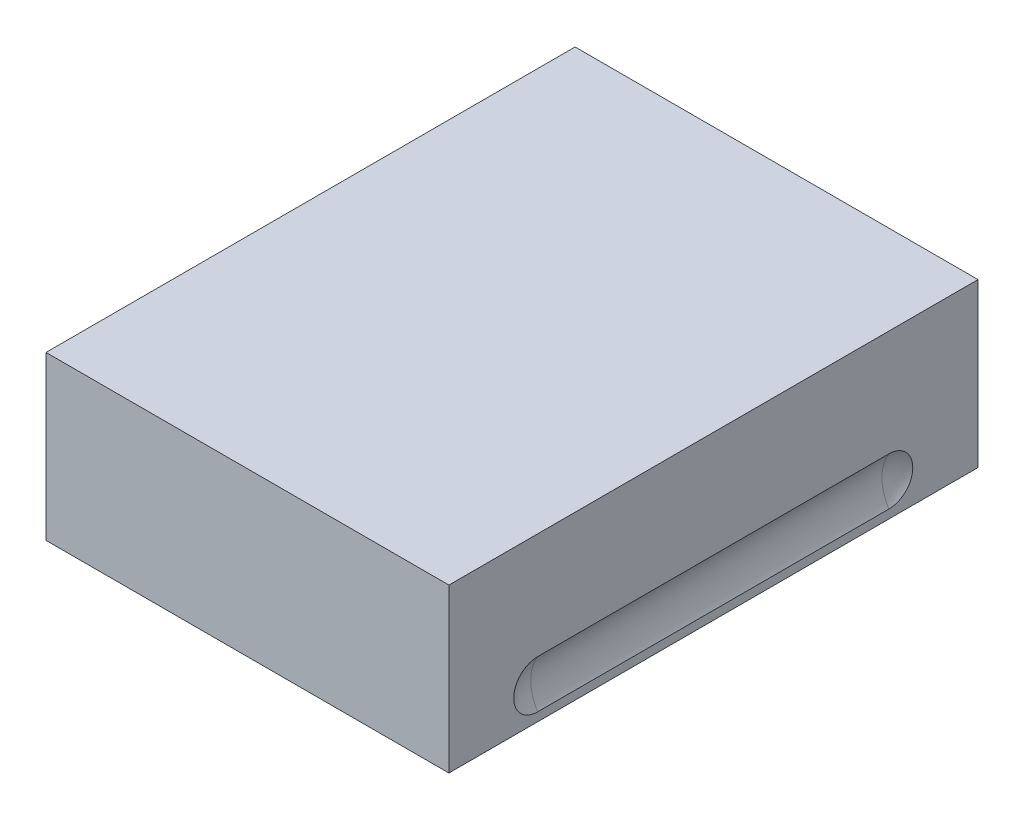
ISO-10303-21;
HEADER;
FILE_DESCRIPTION(('STEP AP214'),'2;1');
FILE_NAME('part.step','',(''),(''),'','','');
FILE_SCHEMA(('AUTOMOTIVE_DESIGN { 1 0 10303 214 1 1 1 1 }'));
ENDSEC;
DATA;
#1=APPLICATION_CONTEXT('core data for automotive mechanical design processes');
#2=APPLICATION_PROTOCOL_DEFINITION('international standard','automotive_design',2000,#1);
#3=PRODUCT_CONTEXT('',#1,'mechanical');
#4=PRODUCT('Part','Part','',(#3));
#5=PRODUCT_RELATED_PRODUCT_CATEGORY('part','',(#4));
#6=PRODUCT_DEFINITION_FORMATION('','',#4);
#7=PRODUCT_DEFINITION_CONTEXT('part definition',#1,'design');
#8=PRODUCT_DEFINITION('design','',#6,#7);
#9=PRODUCT_DEFINITION_SHAPE('','',#8);
#10=(LENGTH_UNIT() NAMED_UNIT(*) SI_UNIT(.MILLI.,.METRE.));
#11=(NAMED_UNIT(*) PLANE_ANGLE_UNIT() SI_UNIT($,.RADIAN.));
#12=(NAMED_UNIT(*) SI_UNIT($,.STERADIAN.) SOLID_ANGLE_UNIT());
#13=UNCERTAINTY_MEASURE_WITH_UNIT(LENGTH_MEASURE(1.E-05),#10,'distance_accuracy_value','');
#14=(GEOMETRIC_REPRESENTATION_CONTEXT(3) GLOBAL_UNCERTAINTY_ASSIGNED_CONTEXT((#13)) GLOBAL_UNIT_ASSIGNED_CONTEXT((#10,
#11,#12)) REPRESENTATION_CONTEXT('',''));
#15=CARTESIAN_POINT('',(0.,0.,0.));
#16=DIRECTION('',(0.,0.,1.));
#17=DIRECTION('',(1.,0.,0.));
#18=AXIS2_PLACEMENT_3D('',#15,#16,#17);
#19=CARTESIAN_POINT('',(0.,67.,-125.));
#20=DIRECTION('',(0.,1.,0.));
#21=DIRECTION('',(0.,0.,1.));
#22=AXIS2_PLACEMENT_3D('',#19,#20,#21);
#23=PLANE('',#22);
#24=DIRECTION('',(-1.,0.,0.));
#25=VECTOR('',#24,1.);
#26=CARTESIAN_POINT('',(-16.5,67.,-155.5));
#27=LINE('',#26,#25);
#28=CARTESIAN_POINT('',(-16.5,67.,-155.5));
#29=VERTEX_POINT('',#28);
#30=CARTESIAN_POINT('',(16.5,67.,-155.5));
#31=VERTEX_POINT('',#30);
#32=EDGE_CURVE('E272',#29,#31,#27,.F.);
#33=ORIENTED_EDGE('',*,*,#32,.T.);
#34=DIRECTION('',(0.,0.,-1.));
#35=VECTOR('',#34,1.);
#36=CARTESIAN_POINT('',(16.5,67.,-155.5));
#37=LINE('',#36,#35);
#38=CARTESIAN_POINT('',(16.5,67.,-94.5));
#39=VERTEX_POINT('',#38);
#40=EDGE_CURVE('E271',#31,#39,#37,.F.);
#41=ORIENTED_EDGE('',*,*,#40,.T.);
#42=DIRECTION('',(1.,0.,0.));
#43=VECTOR('',#42,1.);
#44=CARTESIAN_POINT('',(16.5,67.,-94.5));
#45=LINE('',#44,#43);
#46=CARTESIAN_POINT('',(-16.5,67.,-94.5));
#47=VERTEX_POINT('',#46);
#48=EDGE_CURVE('E279',#39,#47,#45,.F.);
#49=ORIENTED_EDGE('',*,*,#48,.T.);
#50=DIRECTION('',(0.,0.,1.));
#51=VECTOR('',#50,1.);
#52=CARTESIAN_POINT('',(-16.5,67.,-94.5));
#53=LINE('',#52,#51);
#54=EDGE_CURVE('E80',#47,#29,#53,.F.);
#55=ORIENTED_EDGE('',*,*,#54,.T.);
#56=EDGE_LOOP('',(#33,#41,#49,#55));
#57=FACE_BOUND('',#56,.T.);
#58=ADVANCED_FACE('F14',(#57),#23,.F.);
#59=CARTESIAN_POINT('',(-16.5,55.,-155.5));
#60=DIRECTION('',(0.,0.,-1.));
#61=DIRECTION('',(-1.,0.,0.));
#62=AXIS2_PLACEMENT_3D('',#59,#60,#61);
#63=PLANE('',#62);
#64=DIRECTION('',(0.,1.,0.));
#65=VECTOR('',#64,1.);
#66=CARTESIAN_POINT('',(-16.5,55.,-155.5));
#67=LINE('',#66,#65);
#68=CARTESIAN_POINT('',(-16.5,55.,-155.5));
#69=VERTEX_POINT('',#68);
#70=EDGE_CURVE('E250',#29,#69,#67,.F.);
#71=ORIENTED_EDGE('',*,*,#70,.T.);
#72=DIRECTION('',(1.,0.,0.));
#73=VECTOR('',#72,1.);
#74=CARTESIAN_POINT('',(0.,55.,-155.5));
#75=LINE('',#74,#73);
#76=CARTESIAN_POINT('',(16.5,55.,-155.5));
#77=VERTEX_POINT('',#76);
#78=EDGE_CURVE('E218',#69,#77,#75,.T.);
#79=ORIENTED_EDGE('',*,*,#78,.T.);
#80=DIRECTION('',(0.,1.,0.));
#81=VECTOR('',#80,1.);
#82=CARTESIAN_POINT('',(16.5,55.,-155.5));
#83=LINE('',#82,#81);
#84=EDGE_CURVE('E263',#77,#31,#83,.T.);
#85=ORIENTED_EDGE('',*,*,#84,.T.);
#86=ORIENTED_EDGE('',*,*,#32,.F.);
#87=EDGE_LOOP('',(#71,#79,#85,#86));
#88=FACE_BOUND('',#87,.T.);
#89=ADVANCED_FACE('F260',(#88),#63,.F.);
#90=CARTESIAN_POINT('',(16.5,55.,-155.5));
#91=DIRECTION('',(1.,0.,0.));
#92=DIRECTION('',(0.,0.,-1.));
#93=AXIS2_PLACEMENT_3D('',#90,#91,#92);
#94=PLANE('',#93);
#95=ORIENTED_EDGE('',*,*,#84,.F.);
#96=DIRECTION('',(0.,0.,1.));
#97=VECTOR('',#96,1.);
#98=CARTESIAN_POINT('',(16.5,55.,-125.));
#99=LINE('',#98,#97);
#100=CARTESIAN_POINT('',(16.5,55.,-94.5));
#101=VERTEX_POINT('',#100);
#102=EDGE_CURVE('E221',#77,#101,#99,.T.);
#103=ORIENTED_EDGE('',*,*,#102,.T.);
#104=DIRECTION('',(0.,1.,0.));
#105=VECTOR('',#104,1.);
#106=CARTESIAN_POINT('',(16.5,55.,-94.5));
#107=LINE('',#106,#105);
#108=EDGE_CURVE('E274',#101,#39,#107,.T.);
#109=ORIENTED_EDGE('',*,*,#108,.T.);
#110=ORIENTED_EDGE('',*,*,#40,.F.);
#111=EDGE_LOOP('',(#95,#103,#109,#110));
#112=FACE_BOUND('',#111,.T.);
#113=ADVANCED_FACE('F268',(#112),#94,.F.);
#114=CARTESIAN_POINT('',(16.5,55.,-94.5));
#115=DIRECTION('',(0.,0.,1.));
#116=DIRECTION('',(1.,0.,0.));
#117=AXIS2_PLACEMENT_3D('',#114,#115,#116);
#118=PLANE('',#117);
#119=ORIENTED_EDGE('',*,*,#108,.F.);
#120=DIRECTION('',(1.,0.,0.));
#121=VECTOR('',#120,1.);
#122=CARTESIAN_POINT('',(0.,55.,-94.5));
#123=LINE('',#122,#121);
#124=CARTESIAN_POINT('',(-16.5,55.,-94.5));
#125=VERTEX_POINT('',#124);
#126=EDGE_CURVE('E233',#101,#125,#123,.F.);
#127=ORIENTED_EDGE('',*,*,#126,.T.);
#128=DIRECTION('',(0.,1.,0.));
#129=VECTOR('',#128,1.);
#130=CARTESIAN_POINT('',(-16.5,55.,-94.5));
#131=LINE('',#130,#129);
#132=EDGE_CURVE('E251',#125,#47,#131,.T.);
#133=ORIENTED_EDGE('',*,*,#132,.T.);
#134=ORIENTED_EDGE('',*,*,#48,.F.);
#135=EDGE_LOOP('',(#119,#127,#133,#134));
#136=FACE_BOUND('',#135,.T.);
#137=ADVANCED_FACE('F288',(#136),#118,.F.);
#138=CARTESIAN_POINT('',(-16.5,55.,-94.5));
#139=DIRECTION('',(-1.,0.,0.));
#140=DIRECTION('',(0.,0.,1.));
#141=AXIS2_PLACEMENT_3D('',#138,#139,#140);
#142=PLANE('',#141);
#143=ORIENTED_EDGE('',*,*,#132,.F.);
#144=DIRECTION('',(0.,0.,1.));
#145=VECTOR('',#144,1.);
#146=CARTESIAN_POINT('',(-16.5,55.,-125.));
#147=LINE('',#146,#145);
#148=EDGE_CURVE('E93',#125,#69,#147,.F.);
#149=ORIENTED_EDGE('',*,*,#148,.T.);
#150=ORIENTED_EDGE('',*,*,#70,.F.);
#151=ORIENTED_EDGE('',*,*,#54,.F.);
#152=EDGE_LOOP('',(#143,#149,#150,#151));
#153=FACE_BOUND('',#152,.T.);
#154=ADVANCED_FACE('F246',(#153),#142,.F.);
#155=CARTESIAN_POINT('',(-58.8,63.,-168.1));
#156=DIRECTION('',(0.466248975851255,0.113123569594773,0.877390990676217));
#157=DIRECTION('',(0.175928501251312,0.960124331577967,-0.217279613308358));
#158=AXIS2_PLACEMENT_3D('',#155,#156,#157);
#159=SPHERICAL_SURFACE('',#158,11.0000000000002);
#160=CARTESIAN_POINT('',(-58.8,63.,-168.1));
#161=DIRECTION('',(0.,0.,-1.));
#162=DIRECTION('',(-1.,0.,0.));
#163=AXIS2_PLACEMENT_3D('',#160,#161,#162);
#164=CIRCLE('',#163,11.);
#165=CARTESIAN_POINT('',(-49.5,57.12547874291,-168.1));
#166=VERTEX_POINT('',#165);
#167=CARTESIAN_POINT('',(-49.5,68.8745212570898,-168.1));
#168=VERTEX_POINT('',#167);
#169=EDGE_CURVE('E18',#166,#168,#164,.F.);
#170=ORIENTED_EDGE('',*,*,#169,.T.);
#171=CARTESIAN_POINT('',(-49.5,57.1254787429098,-168.1));
#172=CARTESIAN_POINT('',(-49.5,57.1254609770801,-168.265222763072));
#173=CARTESIAN_POINT('',(-49.5,57.1324484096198,-168.430442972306));
#174=CARTESIAN_POINT('',(-49.5,57.1603053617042,-168.759701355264));
#175=CARTESIAN_POINT('',(-49.5,57.1811742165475,-168.923739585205));
#176=CARTESIAN_POINT('',(-49.5,57.2366462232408,-169.249358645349));
#177=CARTESIAN_POINT('',(-49.5,57.2712397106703,-169.410941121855));
#178=CARTESIAN_POINT('',(-49.5,57.3539093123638,-169.730617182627));
#179=CARTESIAN_POINT('',(-49.5,57.4019852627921,-169.888710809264));
#180=CARTESIAN_POINT('',(-49.5,57.5112955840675,-170.200332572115));
#181=CARTESIAN_POINT('',(-49.5,57.572533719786,-170.35385938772));
#182=CARTESIAN_POINT('',(-49.5,57.7077496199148,-170.655264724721));
#183=CARTESIAN_POINT('',(-49.5,57.7817320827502,-170.803141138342));
#184=CARTESIAN_POINT('',(-49.5,57.9418494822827,-171.092051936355));
#185=CARTESIAN_POINT('',(-49.5,58.0279775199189,-171.23309014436));
#186=CARTESIAN_POINT('',(-49.5,58.2118396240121,-171.507462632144));
#187=CARTESIAN_POINT('',(-49.5,58.3095779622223,-171.640794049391));
#188=CARTESIAN_POINT('',(-49.5,58.5159043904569,-171.89870361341));
#189=CARTESIAN_POINT('',(-49.5,58.6244887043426,-172.023284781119));
#190=CARTESIAN_POINT('',(-49.5,58.8518058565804,-172.262903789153));
#191=CARTESIAN_POINT('',(-49.5,58.9705424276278,-172.377938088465));
#192=CARTESIAN_POINT('',(-49.5,59.2172584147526,-172.597570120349));
#193=CARTESIAN_POINT('',(-49.5,59.3452358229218,-172.70217010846));
#194=CARTESIAN_POINT('',(-49.5,59.6095954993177,-172.900255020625));
#195=CARTESIAN_POINT('',(-49.5,59.7459808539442,-172.993735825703));
#196=CARTESIAN_POINT('',(-49.5,60.0260855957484,-173.168836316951));
#197=CARTESIAN_POINT('',(-49.5,60.1698019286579,-173.250460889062));
#198=CARTESIAN_POINT('',(-49.5,60.4636534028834,-173.401342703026));
#199=CARTESIAN_POINT('',(-49.5,60.6137908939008,-173.470595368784));
#200=CARTESIAN_POINT('',(-49.5,60.9193010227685,-173.596176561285));
#201=CARTESIAN_POINT('',(-49.5,61.0746713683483,-173.65251066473));
#202=CARTESIAN_POINT('',(-49.5,61.3896627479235,-173.751911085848));
#203=CARTESIAN_POINT('',(-49.5,61.5492853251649,-173.794972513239));
#204=CARTESIAN_POINT('',(-49.5,61.8715365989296,-173.867480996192));
#205=CARTESIAN_POINT('',(-49.5,62.0341642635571,-173.896932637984));
#206=CARTESIAN_POINT('',(-49.5,62.3613792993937,-173.942041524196));
#207=CARTESIAN_POINT('',(-49.5,62.5259673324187,-173.957693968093));
#208=CARTESIAN_POINT('',(-49.5,62.855852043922,-173.975074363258));
#209=CARTESIAN_POINT('',(-49.5,63.0211486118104,-173.976804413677));
#210=CARTESIAN_POINT('',(-49.5,63.351299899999,-173.966333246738));
#211=CARTESIAN_POINT('',(-49.5,63.516154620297,-173.954132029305));
#212=CARTESIAN_POINT('',(-49.5,63.8442771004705,-173.915881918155));
#213=CARTESIAN_POINT('',(-49.5,64.0075445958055,-173.889830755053));
#214=CARTESIAN_POINT('',(-49.5,64.3312476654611,-173.824076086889));
#215=CARTESIAN_POINT('',(-49.5,64.4916842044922,-173.784377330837));
#216=CARTESIAN_POINT('',(-49.5,64.8086997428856,-173.691591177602));
#217=CARTESIAN_POINT('',(-49.5,64.9652773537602,-173.63849903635));
#218=CARTESIAN_POINT('',(-49.5,65.2733455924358,-173.519332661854));
#219=CARTESIAN_POINT('',(-49.5,65.4248380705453,-173.453263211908));
#220=CARTESIAN_POINT('',(-49.5,65.7217786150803,-173.308570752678));
#221=CARTESIAN_POINT('',(-49.5,65.8672242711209,-173.229942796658));
#222=CARTESIAN_POINT('',(-49.5,66.1509207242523,-173.060742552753));
#223=CARTESIAN_POINT('',(-49.5,66.2891741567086,-172.970174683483));
#224=CARTESIAN_POINT('',(-49.5,66.5576043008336,-172.777685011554));
#225=CARTESIAN_POINT('',(-49.5,66.6877784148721,-172.6757595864));
#226=CARTESIAN_POINT('',(-49.5,66.9390295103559,-172.461342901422));
#227=CARTESIAN_POINT('',(-49.5,67.0601098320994,-172.348855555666));
#228=CARTESIAN_POINT('',(-49.5,67.2923933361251,-172.114054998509));
#229=CARTESIAN_POINT('',(-49.5,67.4035941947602,-171.991739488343));
#230=CARTESIAN_POINT('',(-49.5,67.6152570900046,-171.738222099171));
#231=CARTESIAN_POINT('',(-49.5,67.7157230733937,-171.607023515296));
#232=CARTESIAN_POINT('',(-49.5,67.9053147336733,-171.33653871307));
#233=CARTESIAN_POINT('',(-49.5,67.9944325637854,-171.197246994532));
#234=CARTESIAN_POINT('',(-49.5,68.1605822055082,-170.91170173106));
#235=CARTESIAN_POINT('',(-49.5,68.237618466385,-170.765450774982));
#236=CARTESIAN_POINT('',(-49.5,68.3791664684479,-170.466832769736));
#237=CARTESIAN_POINT('',(-49.5,68.4436658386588,-170.314459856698));
#238=CARTESIAN_POINT('',(-49.5,68.5595645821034,-170.004875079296));
#239=CARTESIAN_POINT('',(-49.5,68.6109688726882,-169.847665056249));
#240=CARTESIAN_POINT('',(-49.5,68.7002936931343,-169.529651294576));
#241=CARTESIAN_POINT('',(-49.5,68.7382290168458,-169.368851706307));
#242=CARTESIAN_POINT('',(-49.5,68.8004112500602,-169.044693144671));
#243=CARTESIAN_POINT('',(-49.5,68.8246648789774,-168.88133546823));
#244=CARTESIAN_POINT('',(-49.5,68.8528409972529,-168.614685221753));
#245=CARTESIAN_POINT('',(-49.5,68.8609762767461,-168.51181948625));
#246=CARTESIAN_POINT('',(-49.5,68.8718125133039,-168.305972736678));
#247=CARTESIAN_POINT('',(-49.5,68.8745224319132,-168.202992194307));
#248=CARTESIAN_POINT('',(-49.5,68.8745212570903,-168.1));
#249=B_SPLINE_CURVE_WITH_KNOTS('',3,(#171,#172,#173,#174,#175,#176,#177,#178,#179,#180,#181,
#182,#183,#184,#185,#186,#187,#188,#189,#190,#191,#192,#193,#194,#195,#196,#197,#198,#199,#200,
#201,#202,#203,#204,#205,#206,#207,#208,#209,#210,#211,#212,#213,#214,#215,#216,#217,#218,#219,
#220,#221,#222,#223,#224,#225,#226,#227,#228,#229,#230,#231,#232,#233,#234,#235,#236,#237,#238,
#239,#240,#241,#242,#243,#244,#245,#246,#247,#248),.UNSPECIFIED.,.F.,.F.,(4,2,2,2,2,2,2,2,2,2,2,
2,2,2,2,2,2,2,2,2,2,2,2,2,2,2,2,2,2,2,2,2,2,2,2,2,2,2,4),(0.,0.495516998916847,
0.991010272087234,1.4861552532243,1.9812942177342,2.4765749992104,2.97203876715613,
3.46722222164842,3.96258843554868,4.45778277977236,4.95315998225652,5.44842986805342,
5.94388265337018,6.43913068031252,6.93456151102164,7.42977806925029,7.92517687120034,
8.42040861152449,8.91581256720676,9.41114182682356,9.90647108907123,10.40188153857,
10.8971197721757,11.3925336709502,11.8877653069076,12.3831924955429,12.8784368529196,
13.373839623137,13.8690595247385,14.3643955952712,14.8595489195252,15.3550427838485,
15.8503537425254,16.3461510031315,16.8417618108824,17.3368265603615,17.8316479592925,
18.1410772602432,18.4499950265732),.UNSPECIFIED.);
#250=EDGE_CURVE('E77',#166,#168,#249,.T.);
#251=ORIENTED_EDGE('',*,*,#250,.F.);
#252=EDGE_LOOP('',(#170,#251));
#253=FACE_BOUND('',#252,.T.);
#254=ADVANCED_FACE('F75',(#253),#159,.F.);
#255=CARTESIAN_POINT('',(-58.8,63.,-124.95));
#256=DIRECTION('',(0.,0.,-1.));
#257=DIRECTION('',(-1.,0.,0.));
#258=AXIS2_PLACEMENT_3D('',#255,#256,#257);
#259=CYLINDRICAL_SURFACE('',#258,11.);
#260=ORIENTED_EDGE('',*,*,#169,.F.);
#261=DIRECTION('',(0.,0.,1.));
#262=VECTOR('',#261,1.);
#263=CARTESIAN_POINT('',(-49.5,57.1254787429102,-60.));
#264=LINE('',#263,#262);
#265=CARTESIAN_POINT('',(-49.5,57.1254787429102,-81.8));
#266=VERTEX_POINT('',#265);
#267=EDGE_CURVE('E91',#266,#166,#264,.F.);
#268=ORIENTED_EDGE('',*,*,#267,.F.);
#269=CARTESIAN_POINT('',(-58.8,63.,-81.8));
#270=DIRECTION('',(0.,0.,-1.));
#271=DIRECTION('',(-1.,0.,0.));
#272=AXIS2_PLACEMENT_3D('',#269,#270,#271);
#273=CIRCLE('',#272,11.);
#274=CARTESIAN_POINT('',(-49.5,68.87452125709,-81.8));
#275=VERTEX_POINT('',#274);
#276=EDGE_CURVE('E79',#266,#275,#273,.F.);
#277=ORIENTED_EDGE('',*,*,#276,.T.);
#278=DIRECTION('',(0.,0.,1.));
#279=VECTOR('',#278,1.);
#280=CARTESIAN_POINT('',(-49.5,68.8745212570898,-60.));
#281=LINE('',#280,#279);
#282=EDGE_CURVE('E82',#168,#275,#281,.T.);
#283=ORIENTED_EDGE('',*,*,#282,.F.);
#284=EDGE_LOOP('',(#260,#268,#277,#283));
#285=FACE_BOUND('',#284,.T.);
#286=ADVANCED_FACE('F83',(#285),#259,.F.);
#287=CARTESIAN_POINT('',(-58.8,63.,-81.8));
#288=DIRECTION('',(0.466248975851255,0.113123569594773,0.877390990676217));
#289=DIRECTION('',(0.175928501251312,0.960124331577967,-0.217279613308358));
#290=AXIS2_PLACEMENT_3D('',#287,#288,#289);
#291=SPHERICAL_SURFACE('',#290,11.0000000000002);
#292=ORIENTED_EDGE('',*,*,#276,.F.);
#293=CARTESIAN_POINT('',(-49.5,68.8745212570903,-81.8));
#294=CARTESIAN_POINT('',(-49.5,68.8745390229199,-81.6347772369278));
#295=CARTESIAN_POINT('',(-49.5,68.8675515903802,-81.469557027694));
#296=CARTESIAN_POINT('',(-49.5,68.8396946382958,-81.1402986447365));
#297=CARTESIAN_POINT('',(-49.5,68.8188257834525,-80.9762604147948));
#298=CARTESIAN_POINT('',(-49.5,68.7633537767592,-80.6506413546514));
#299=CARTESIAN_POINT('',(-49.5,68.7287602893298,-80.4890588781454));
#300=CARTESIAN_POINT('',(-49.5,68.6460906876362,-80.1693828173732));
#301=CARTESIAN_POINT('',(-49.5,68.5980147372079,-80.0112891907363));
#302=CARTESIAN_POINT('',(-49.5,68.4887044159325,-79.6996674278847));
#303=CARTESIAN_POINT('',(-49.5,68.427466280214,-79.5461406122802));
#304=CARTESIAN_POINT('',(-49.5,68.2922503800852,-79.2447352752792));
#305=CARTESIAN_POINT('',(-49.5,68.2182679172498,-79.0968588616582));
#306=CARTESIAN_POINT('',(-49.5,68.0581505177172,-78.8079480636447));
#307=CARTESIAN_POINT('',(-49.5,67.9720224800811,-78.6669098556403));
#308=CARTESIAN_POINT('',(-49.5,67.7881603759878,-78.3925373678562));
#309=CARTESIAN_POINT('',(-49.5,67.6904220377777,-78.2592059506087));
#310=CARTESIAN_POINT('',(-49.5,67.4840956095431,-78.0012963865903));
#311=CARTESIAN_POINT('',(-49.5,67.3755112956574,-77.8767152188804));
#312=CARTESIAN_POINT('',(-49.5,67.1481941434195,-77.6370962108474));
#313=CARTESIAN_POINT('',(-49.5,67.0294575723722,-77.5220619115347));
#314=CARTESIAN_POINT('',(-49.5,66.7827415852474,-77.3024298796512));
#315=CARTESIAN_POINT('',(-49.5,66.6547641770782,-77.1978298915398));
#316=CARTESIAN_POINT('',(-49.5,66.3904045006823,-76.9997449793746));
#317=CARTESIAN_POINT('',(-49.5,66.2540191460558,-76.9062641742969));
#318=CARTESIAN_POINT('',(-49.5,65.9739144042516,-76.731163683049));
#319=CARTESIAN_POINT('',(-49.5,65.8301980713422,-76.649539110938));
#320=CARTESIAN_POINT('',(-49.5,65.5363465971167,-76.4986572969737));
#321=CARTESIAN_POINT('',(-49.5,65.3862091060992,-76.429404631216));
#322=CARTESIAN_POINT('',(-49.5,65.0806989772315,-76.3038234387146));
#323=CARTESIAN_POINT('',(-49.5,64.9253286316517,-76.24748933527));
#324=CARTESIAN_POINT('',(-49.5,64.6103372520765,-76.1480889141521));
#325=CARTESIAN_POINT('',(-49.5,64.4507146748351,-76.1050274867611));
#326=CARTESIAN_POINT('',(-49.5,64.1284634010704,-76.0325190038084));
#327=CARTESIAN_POINT('',(-49.5,63.9658357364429,-76.0030673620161));
#328=CARTESIAN_POINT('',(-49.5,63.6386207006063,-75.9579584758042));
#329=CARTESIAN_POINT('',(-49.5,63.4740326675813,-75.9423060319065));
#330=CARTESIAN_POINT('',(-49.5,63.1441479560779,-75.9249256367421));
#331=CARTESIAN_POINT('',(-49.5,62.9788513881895,-75.9231955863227));
#332=CARTESIAN_POINT('',(-49.5,62.6487001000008,-75.9336667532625));
#333=CARTESIAN_POINT('',(-49.5,62.4838453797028,-75.9458679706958));
#334=CARTESIAN_POINT('',(-49.5,62.1557228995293,-75.9841180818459));
#335=CARTESIAN_POINT('',(-49.5,61.9924554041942,-76.010169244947));
#336=CARTESIAN_POINT('',(-49.5,61.6687523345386,-76.0759239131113));
#337=CARTESIAN_POINT('',(-49.5,61.5083157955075,-76.1156226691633));
#338=CARTESIAN_POINT('',(-49.5,61.1913002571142,-76.2084088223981));
#339=CARTESIAN_POINT('',(-49.5,61.0347226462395,-76.2615009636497));
#340=CARTESIAN_POINT('',(-49.5,60.7266544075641,-76.3806673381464));
#341=CARTESIAN_POINT('',(-49.5,60.5751619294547,-76.4467367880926));
#342=CARTESIAN_POINT('',(-49.5,60.2782213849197,-76.5914292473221));
#343=CARTESIAN_POINT('',(-49.5,60.132775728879,-76.6700572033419));
#344=CARTESIAN_POINT('',(-49.5,59.8490792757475,-76.8392574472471));
#345=CARTESIAN_POINT('',(-49.5,59.7108258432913,-76.9298253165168));
#346=CARTESIAN_POINT('',(-49.5,59.4423956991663,-77.1223149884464));
#347=CARTESIAN_POINT('',(-49.5,59.3122215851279,-77.2242404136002));
#348=CARTESIAN_POINT('',(-49.5,59.0609704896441,-77.4386570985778));
#349=CARTESIAN_POINT('',(-49.5,58.9398901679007,-77.5511444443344));
#350=CARTESIAN_POINT('',(-49.5,58.707606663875,-77.7859450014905));
#351=CARTESIAN_POINT('',(-49.5,58.5964058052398,-77.9082605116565));
#352=CARTESIAN_POINT('',(-49.5,58.3847429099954,-78.161777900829));
#353=CARTESIAN_POINT('',(-49.5,58.2842769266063,-78.2929764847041));
#354=CARTESIAN_POINT('',(-49.5,58.0946852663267,-78.5634612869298));
#355=CARTESIAN_POINT('',(-49.5,58.0055674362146,-78.702753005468));
#356=CARTESIAN_POINT('',(-49.5,57.8394177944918,-78.9882982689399));
#357=CARTESIAN_POINT('',(-49.5,57.7623815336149,-79.1345492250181));
#358=CARTESIAN_POINT('',(-49.5,57.6208335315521,-79.4331672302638));
#359=CARTESIAN_POINT('',(-49.5,57.5563341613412,-79.5855401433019));
#360=CARTESIAN_POINT('',(-49.5,57.4404354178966,-79.8951249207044));
#361=CARTESIAN_POINT('',(-49.5,57.3890311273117,-80.0523349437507));
#362=CARTESIAN_POINT('',(-49.5,57.2997063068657,-80.3703487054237));
#363=CARTESIAN_POINT('',(-49.5,57.2617709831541,-80.531148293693));
#364=CARTESIAN_POINT('',(-49.5,57.1995887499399,-80.8553068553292));
#365=CARTESIAN_POINT('',(-49.5,57.1753351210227,-81.0186645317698));
#366=CARTESIAN_POINT('',(-49.5,57.1471590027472,-81.2853147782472));
#367=CARTESIAN_POINT('',(-49.5,57.1390237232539,-81.3881805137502));
#368=CARTESIAN_POINT('',(-49.5,57.128187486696,-81.5940272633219));
#369=CARTESIAN_POINT('',(-49.5,57.1254775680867,-81.6970078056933));
#370=CARTESIAN_POINT('',(-49.5,57.1254787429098,-81.8));
#371=B_SPLINE_CURVE_WITH_KNOTS('',3,(#293,#294,#295,#296,#297,#298,#299,#300,#301,#302,#303,
#304,#305,#306,#307,#308,#309,#310,#311,#312,#313,#314,#315,#316,#317,#318,#319,#320,#321,#322,
#323,#324,#325,#326,#327,#328,#329,#330,#331,#332,#333,#334,#335,#336,#337,#338,#339,#340,#341,
#342,#343,#344,#345,#346,#347,#348,#349,#350,#351,#352,#353,#354,#355,#356,#357,#358,#359,#360,
#361,#362,#363,#364,#365,#366,#367,#368,#369,#370),.UNSPECIFIED.,.F.,.F.,(4,2,2,2,2,2,2,2,2,2,2,
2,2,2,2,2,2,2,2,2,2,2,2,2,2,2,2,2,2,2,2,2,2,2,2,2,2,2,4),(0.,0.495516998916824,
0.991010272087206,1.48615525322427,1.9812942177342,2.47657499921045,2.97203876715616,
3.46722222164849,3.96258843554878,4.45778277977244,4.95315998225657,5.44842986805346,
5.94388265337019,6.43913068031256,6.93456151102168,7.42977806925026,7.92517687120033,
8.42040861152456,8.91581256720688,9.41114182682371,9.90647108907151,10.4018815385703,
10.897119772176,11.3925336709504,11.8877653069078,12.383192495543,12.8784368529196,
13.3738396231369,13.8690595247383,14.364395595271,14.8595489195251,15.3550427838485,
15.8503537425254,16.3461510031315,16.8417618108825,17.3368265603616,17.8316479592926,
18.1410772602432,18.4499950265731),.UNSPECIFIED.);
#372=EDGE_CURVE('E88',#275,#266,#371,.T.);
#373=ORIENTED_EDGE('',*,*,#372,.F.);
#374=EDGE_LOOP('',(#292,#373));
#375=FACE_BOUND('',#374,.T.);
#376=ADVANCED_FACE('F154',(#375),#291,.F.);
#377=CARTESIAN_POINT('',(58.8,63.,-81.8));
#378=DIRECTION('',(0.466248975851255,0.113123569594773,0.877390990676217));
#379=DIRECTION('',(0.175928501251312,0.960124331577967,-0.217279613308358));
#380=AXIS2_PLACEMENT_3D('',#377,#378,#379);
#381=SPHERICAL_SURFACE('',#380,11.0000000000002);
#382=CARTESIAN_POINT('',(58.8,63.,-81.8));
#383=DIRECTION('',(0.,0.,1.));
#384=DIRECTION('',(1.,0.,0.));
#385=AXIS2_PLACEMENT_3D('',#382,#383,#384);
#386=CIRCLE('',#385,11.);
#387=CARTESIAN_POINT('',(49.5,57.12547874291,-81.8));
#388=VERTEX_POINT('',#387);
#389=CARTESIAN_POINT('',(49.5,68.8745212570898,-81.8));
#390=VERTEX_POINT('',#389);
#391=EDGE_CURVE('E219',#388,#390,#386,.F.);
#392=ORIENTED_EDGE('',*,*,#391,.T.);
#393=CARTESIAN_POINT('',(49.5,57.1254787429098,-81.8));
#394=CARTESIAN_POINT('',(49.5,57.1254609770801,-81.6347772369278));
#395=CARTESIAN_POINT('',(49.5,57.1324484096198,-81.469557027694));
#396=CARTESIAN_POINT('',(49.5,57.1603053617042,-81.1402986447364));
#397=CARTESIAN_POINT('',(49.5,57.1811742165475,-80.9762604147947));
#398=CARTESIAN_POINT('',(49.5,57.2366462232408,-80.6506413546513));
#399=CARTESIAN_POINT('',(49.5,57.2712397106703,-80.4890588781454));
#400=CARTESIAN_POINT('',(49.5,57.3539093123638,-80.1693828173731));
#401=CARTESIAN_POINT('',(49.5,57.401985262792,-80.0112891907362));
#402=CARTESIAN_POINT('',(49.5,57.5112955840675,-79.6996674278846));
#403=CARTESIAN_POINT('',(49.5,57.572533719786,-79.5461406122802));
#404=CARTESIAN_POINT('',(49.5,57.7077496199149,-79.2447352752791));
#405=CARTESIAN_POINT('',(49.5,57.7817320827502,-79.0968588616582));
#406=CARTESIAN_POINT('',(49.5,57.9418494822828,-78.8079480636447));
#407=CARTESIAN_POINT('',(49.5,58.027977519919,-78.6669098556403));
#408=CARTESIAN_POINT('',(49.5,58.2118396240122,-78.3925373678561));
#409=CARTESIAN_POINT('',(49.5,58.3095779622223,-78.2592059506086));
#410=CARTESIAN_POINT('',(49.5,58.5159043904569,-78.0012963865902));
#411=CARTESIAN_POINT('',(49.5,58.6244887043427,-77.8767152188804));
#412=CARTESIAN_POINT('',(49.5,58.8518058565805,-77.6370962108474));
#413=CARTESIAN_POINT('',(49.5,58.9705424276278,-77.5220619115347));
#414=CARTESIAN_POINT('',(49.5,59.2172584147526,-77.3024298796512));
#415=CARTESIAN_POINT('',(49.5,59.3452358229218,-77.1978298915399));
#416=CARTESIAN_POINT('',(49.5,59.6095954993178,-76.9997449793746));
#417=CARTESIAN_POINT('',(49.5,59.7459808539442,-76.9062641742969));
#418=CARTESIAN_POINT('',(49.5,60.0260855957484,-76.731163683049));
#419=CARTESIAN_POINT('',(49.5,60.1698019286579,-76.649539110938));
#420=CARTESIAN_POINT('',(49.5,60.4636534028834,-76.4986572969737));
#421=CARTESIAN_POINT('',(49.5,60.6137908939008,-76.429404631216));
#422=CARTESIAN_POINT('',(49.5,60.9193010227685,-76.3038234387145));
#423=CARTESIAN_POINT('',(49.5,61.0746713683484,-76.24748933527));
#424=CARTESIAN_POINT('',(49.5,61.3896627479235,-76.1480889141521));
#425=CARTESIAN_POINT('',(49.5,61.5492853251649,-76.105027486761));
#426=CARTESIAN_POINT('',(49.5,61.8715365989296,-76.0325190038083));
#427=CARTESIAN_POINT('',(49.5,62.0341642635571,-76.0030673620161));
#428=CARTESIAN_POINT('',(49.5,62.3613792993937,-75.9579584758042));
#429=CARTESIAN_POINT('',(49.5,62.5259673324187,-75.9423060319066));
#430=CARTESIAN_POINT('',(49.5,62.8558520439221,-75.9249256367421));
#431=CARTESIAN_POINT('',(49.5,63.0211486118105,-75.9231955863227));
#432=CARTESIAN_POINT('',(49.5,63.3512998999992,-75.9336667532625));
#433=CARTESIAN_POINT('',(49.5,63.5161546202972,-75.9458679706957));
#434=CARTESIAN_POINT('',(49.5,63.8442771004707,-75.9841180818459));
#435=CARTESIAN_POINT('',(49.5,64.0075445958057,-76.010169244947));
#436=CARTESIAN_POINT('',(49.5,64.3312476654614,-76.0759239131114));
#437=CARTESIAN_POINT('',(49.5,64.4916842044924,-76.1156226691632));
#438=CARTESIAN_POINT('',(49.5,64.8086997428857,-76.2084088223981));
#439=CARTESIAN_POINT('',(49.5,64.9652773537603,-76.2615009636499));
#440=CARTESIAN_POINT('',(49.5,65.2733455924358,-76.3806673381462));
#441=CARTESIAN_POINT('',(49.5,65.4248380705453,-76.446736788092));
#442=CARTESIAN_POINT('',(49.5,65.7217786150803,-76.5914292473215));
#443=CARTESIAN_POINT('',(49.5,65.8672242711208,-76.6700572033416));
#444=CARTESIAN_POINT('',(49.5,66.1509207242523,-76.8392574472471));
#445=CARTESIAN_POINT('',(49.5,66.2891741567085,-76.9298253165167));
#446=CARTESIAN_POINT('',(49.5,66.5576043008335,-77.1223149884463));
#447=CARTESIAN_POINT('',(49.5,66.6877784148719,-77.2242404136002));
#448=CARTESIAN_POINT('',(49.5,66.9390295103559,-77.4386570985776));
#449=CARTESIAN_POINT('',(49.5,67.0601098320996,-77.5511444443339));
#450=CARTESIAN_POINT('',(49.5,67.2923933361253,-77.78594500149));
#451=CARTESIAN_POINT('',(49.5,67.4035941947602,-77.9082605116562));
#452=CARTESIAN_POINT('',(49.5,67.6152570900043,-78.161777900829));
#453=CARTESIAN_POINT('',(49.5,67.7157230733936,-78.292976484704));
#454=CARTESIAN_POINT('',(49.5,67.9053147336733,-78.5634612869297));
#455=CARTESIAN_POINT('',(49.5,67.9944325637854,-78.702753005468));
#456=CARTESIAN_POINT('',(49.5,68.1605822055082,-78.9882982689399));
#457=CARTESIAN_POINT('',(49.5,68.237618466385,-79.1345492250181));
#458=CARTESIAN_POINT('',(49.5,68.3791664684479,-79.4331672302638));
#459=CARTESIAN_POINT('',(49.5,68.4436658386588,-79.585540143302));
#460=CARTESIAN_POINT('',(49.5,68.5595645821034,-79.8951249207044));
#461=CARTESIAN_POINT('',(49.5,68.6109688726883,-80.0523349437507));
#462=CARTESIAN_POINT('',(49.5,68.7002936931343,-80.3703487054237));
#463=CARTESIAN_POINT('',(49.5,68.7382290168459,-80.531148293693));
#464=CARTESIAN_POINT('',(49.5,68.8004112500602,-80.8553068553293));
#465=CARTESIAN_POINT('',(49.5,68.8246648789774,-81.0186645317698));
#466=CARTESIAN_POINT('',(49.5,68.8528409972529,-81.2853147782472));
#467=CARTESIAN_POINT('',(49.5,68.8609762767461,-81.3881805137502));
#468=CARTESIAN_POINT('',(49.5,68.871812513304,-81.5940272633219));
#469=CARTESIAN_POINT('',(49.5,68.8745224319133,-81.6970078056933));
#470=CARTESIAN_POINT('',(49.5,68.8745212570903,-81.8));
#471=B_SPLINE_CURVE_WITH_KNOTS('',3,(#393,#394,#395,#396,#397,#398,#399,#400,#401,#402,#403,
#404,#405,#406,#407,#408,#409,#410,#411,#412,#413,#414,#415,#416,#417,#418,#419,#420,#421,#422,
#423,#424,#425,#426,#427,#428,#429,#430,#431,#432,#433,#434,#435,#436,#437,#438,#439,#440,#441,
#442,#443,#444,#445,#446,#447,#448,#449,#450,#451,#452,#453,#454,#455,#456,#457,#458,#459,#460,
#461,#462,#463,#464,#465,#466,#467,#468,#469,#470),.UNSPECIFIED.,.F.,.F.,(4,2,2,2,2,2,2,2,2,2,2,
2,2,2,2,2,2,2,2,2,2,2,2,2,2,2,2,2,2,2,2,2,2,2,2,2,2,2,4),(0.,0.495516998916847,
0.991010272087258,1.48615525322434,1.98129421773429,2.47657499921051,2.97203876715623,
3.46722222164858,3.96258843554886,4.45778277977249,4.9531599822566,5.44842986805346,
5.94388265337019,6.43913068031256,6.9345615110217,7.42977806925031,7.92517687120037,
8.42040861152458,8.91581256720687,9.41114182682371,9.90647108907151,10.4018815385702,
10.8971197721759,11.3925336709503,11.8877653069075,12.3831924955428,12.8784368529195,
13.3738396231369,13.8690595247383,14.364395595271,14.8595489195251,15.3550427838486,
15.8503537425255,16.3461510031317,16.8417618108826,17.3368265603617,17.8316479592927,
18.1410772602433,18.4499950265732),.UNSPECIFIED.);
#472=EDGE_CURVE('E139',#388,#390,#471,.T.);
#473=ORIENTED_EDGE('',*,*,#472,.F.);
#474=EDGE_LOOP('',(#392,#473));
#475=FACE_BOUND('',#474,.T.);
#476=ADVANCED_FACE('F148',(#475),#381,.F.);
#477=CARTESIAN_POINT('',(58.8,63.,-124.95));
#478=DIRECTION('',(0.,0.,1.));
#479=DIRECTION('',(1.,0.,0.));
#480=AXIS2_PLACEMENT_3D('',#477,#478,#479);
#481=CYLINDRICAL_SURFACE('',#480,11.);
#482=ORIENTED_EDGE('',*,*,#391,.F.);
#483=DIRECTION('',(0.,0.,-1.));
#484=VECTOR('',#483,1.);
#485=CARTESIAN_POINT('',(49.5,57.1254787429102,-190.));
#486=LINE('',#485,#484);
#487=CARTESIAN_POINT('',(49.5,57.1254787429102,-168.1));
#488=VERTEX_POINT('',#487);
#489=EDGE_CURVE('E147',#488,#388,#486,.F.);
#490=ORIENTED_EDGE('',*,*,#489,.F.);
#491=CARTESIAN_POINT('',(58.8,63.,-168.1));
#492=DIRECTION('',(0.,0.,1.));
#493=DIRECTION('',(1.,0.,0.));
#494=AXIS2_PLACEMENT_3D('',#491,#492,#493);
#495=CIRCLE('',#494,11.);
#496=CARTESIAN_POINT('',(49.5,68.8745212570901,-168.1));
#497=VERTEX_POINT('',#496);
#498=EDGE_CURVE('E109',#488,#497,#495,.F.);
#499=ORIENTED_EDGE('',*,*,#498,.T.);
#500=DIRECTION('',(0.,0.,-1.));
#501=VECTOR('',#500,1.);
#502=CARTESIAN_POINT('',(49.5,68.8745212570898,-190.));
#503=LINE('',#502,#501);
#504=EDGE_CURVE('E146',#390,#497,#503,.T.);
#505=ORIENTED_EDGE('',*,*,#504,.F.);
#506=EDGE_LOOP('',(#482,#490,#499,#505));
#507=FACE_BOUND('',#506,.T.);
#508=ADVANCED_FACE('F153',(#507),#481,.F.);
#509=CARTESIAN_POINT('',(58.8,63.,-168.1));
#510=DIRECTION('',(0.466248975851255,0.113123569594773,0.877390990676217));
#511=DIRECTION('',(0.175928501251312,0.960124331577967,-0.217279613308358));
#512=AXIS2_PLACEMENT_3D('',#509,#510,#511);
#513=SPHERICAL_SURFACE('',#512,11.0000000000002);
#514=ORIENTED_EDGE('',*,*,#498,.F.);
#515=CARTESIAN_POINT('',(49.5,68.8745212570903,-168.1));
#516=CARTESIAN_POINT('',(49.5,68.8745390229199,-168.265222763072));
#517=CARTESIAN_POINT('',(49.5,68.8675515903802,-168.430442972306));
#518=CARTESIAN_POINT('',(49.5,68.8396946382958,-168.759701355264));
#519=CARTESIAN_POINT('',(49.5,68.8188257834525,-168.923739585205));
#520=CARTESIAN_POINT('',(49.5,68.7633537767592,-169.249358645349));
#521=CARTESIAN_POINT('',(49.5,68.7287602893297,-169.410941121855));
#522=CARTESIAN_POINT('',(49.5,68.6460906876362,-169.730617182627));
#523=CARTESIAN_POINT('',(49.5,68.5980147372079,-169.888710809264));
#524=CARTESIAN_POINT('',(49.5,68.4887044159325,-170.200332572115));
#525=CARTESIAN_POINT('',(49.5,68.427466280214,-170.35385938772));
#526=CARTESIAN_POINT('',(49.5,68.2922503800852,-170.655264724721));
#527=CARTESIAN_POINT('',(49.5,68.2182679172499,-170.803141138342));
#528=CARTESIAN_POINT('',(49.5,68.0581505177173,-171.092051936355));
#529=CARTESIAN_POINT('',(49.5,67.9720224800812,-171.23309014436));
#530=CARTESIAN_POINT('',(49.5,67.7881603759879,-171.507462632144));
#531=CARTESIAN_POINT('',(49.5,67.6904220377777,-171.640794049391));
#532=CARTESIAN_POINT('',(49.5,67.4840956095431,-171.89870361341));
#533=CARTESIAN_POINT('',(49.5,67.3755112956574,-172.02328478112));
#534=CARTESIAN_POINT('',(49.5,67.1481941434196,-172.262903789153));
#535=CARTESIAN_POINT('',(49.5,67.0294575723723,-172.377938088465));
#536=CARTESIAN_POINT('',(49.5,66.7827415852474,-172.597570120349));
#537=CARTESIAN_POINT('',(49.5,66.6547641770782,-172.70217010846));
#538=CARTESIAN_POINT('',(49.5,66.3904045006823,-172.900255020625));
#539=CARTESIAN_POINT('',(49.5,66.2540191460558,-172.993735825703));
#540=CARTESIAN_POINT('',(49.5,65.9739144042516,-173.168836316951));
#541=CARTESIAN_POINT('',(49.5,65.8301980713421,-173.250460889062));
#542=CARTESIAN_POINT('',(49.5,65.5363465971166,-173.401342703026));
#543=CARTESIAN_POINT('',(49.5,65.3862091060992,-173.470595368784));
#544=CARTESIAN_POINT('',(49.5,65.0806989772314,-173.596176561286));
#545=CARTESIAN_POINT('',(49.5,64.9253286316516,-173.65251066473));
#546=CARTESIAN_POINT('',(49.5,64.6103372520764,-173.751911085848));
#547=CARTESIAN_POINT('',(49.5,64.450714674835,-173.794972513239));
#548=CARTESIAN_POINT('',(49.5,64.1284634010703,-173.867480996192));
#549=CARTESIAN_POINT('',(49.5,63.9658357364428,-173.896932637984));
#550=CARTESIAN_POINT('',(49.5,63.6386207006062,-173.942041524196));
#551=CARTESIAN_POINT('',(49.5,63.4740326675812,-173.957693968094));
#552=CARTESIAN_POINT('',(49.5,63.1441479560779,-173.975074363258));
#553=CARTESIAN_POINT('',(49.5,62.9788513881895,-173.976804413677));
#554=CARTESIAN_POINT('',(49.5,62.6487001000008,-173.966333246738));
#555=CARTESIAN_POINT('',(49.5,62.4838453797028,-173.954132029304));
#556=CARTESIAN_POINT('',(49.5,62.1557228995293,-173.915881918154));
#557=CARTESIAN_POINT('',(49.5,61.9924554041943,-173.889830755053));
#558=CARTESIAN_POINT('',(49.5,61.6687523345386,-173.824076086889));
#559=CARTESIAN_POINT('',(49.5,61.5083157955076,-173.784377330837));
#560=CARTESIAN_POINT('',(49.5,61.1913002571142,-173.691591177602));
#561=CARTESIAN_POINT('',(49.5,61.0347226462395,-173.63849903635));
#562=CARTESIAN_POINT('',(49.5,60.7266544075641,-173.519332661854));
#563=CARTESIAN_POINT('',(49.5,60.5751619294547,-173.453263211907));
#564=CARTESIAN_POINT('',(49.5,60.2782213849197,-173.308570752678));
#565=CARTESIAN_POINT('',(49.5,60.132775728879,-173.229942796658));
#566=CARTESIAN_POINT('',(49.5,59.8490792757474,-173.060742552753));
#567=CARTESIAN_POINT('',(49.5,59.7108258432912,-172.970174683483));
#568=CARTESIAN_POINT('',(49.5,59.4423956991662,-172.777685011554));
#569=CARTESIAN_POINT('',(49.5,59.3122215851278,-172.6757595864));
#570=CARTESIAN_POINT('',(49.5,59.0609704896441,-172.461342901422));
#571=CARTESIAN_POINT('',(49.5,58.9398901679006,-172.348855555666));
#572=CARTESIAN_POINT('',(49.5,58.7076066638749,-172.114054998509));
#573=CARTESIAN_POINT('',(49.5,58.5964058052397,-171.991739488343));
#574=CARTESIAN_POINT('',(49.5,58.3847429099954,-171.738222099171));
#575=CARTESIAN_POINT('',(49.5,58.2842769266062,-171.607023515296));
#576=CARTESIAN_POINT('',(49.5,58.0946852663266,-171.33653871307));
#577=CARTESIAN_POINT('',(49.5,58.0055674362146,-171.197246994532));
#578=CARTESIAN_POINT('',(49.5,57.8394177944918,-170.91170173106));
#579=CARTESIAN_POINT('',(49.5,57.7623815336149,-170.765450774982));
#580=CARTESIAN_POINT('',(49.5,57.6208335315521,-170.466832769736));
#581=CARTESIAN_POINT('',(49.5,57.5563341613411,-170.314459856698));
#582=CARTESIAN_POINT('',(49.5,57.4404354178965,-170.004875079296));
#583=CARTESIAN_POINT('',(49.5,57.3890311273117,-169.847665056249));
#584=CARTESIAN_POINT('',(49.5,57.2997063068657,-169.529651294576));
#585=CARTESIAN_POINT('',(49.5,57.2617709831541,-169.368851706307));
#586=CARTESIAN_POINT('',(49.5,57.1995887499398,-169.044693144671));
#587=CARTESIAN_POINT('',(49.5,57.1753351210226,-168.88133546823));
#588=CARTESIAN_POINT('',(49.5,57.1471590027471,-168.614685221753));
#589=CARTESIAN_POINT('',(49.5,57.1390237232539,-168.51181948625));
#590=CARTESIAN_POINT('',(49.5,57.128187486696,-168.305972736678));
#591=CARTESIAN_POINT('',(49.5,57.1254775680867,-168.202992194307));
#592=CARTESIAN_POINT('',(49.5,57.1254787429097,-168.1));
#593=B_SPLINE_CURVE_WITH_KNOTS('',3,(#515,#516,#517,#518,#519,#520,#521,#522,#523,#524,#525,
#526,#527,#528,#529,#530,#531,#532,#533,#534,#535,#536,#537,#538,#539,#540,#541,#542,#543,#544,
#545,#546,#547,#548,#549,#550,#551,#552,#553,#554,#555,#556,#557,#558,#559,#560,#561,#562,#563,
#564,#565,#566,#567,#568,#569,#570,#571,#572,#573,#574,#575,#576,#577,#578,#579,#580,#581,#582,
#583,#584,#585,#586,#587,#588,#589,#590,#591,#592),.UNSPECIFIED.,.F.,.F.,(4,2,2,2,2,2,2,2,2,2,2,
2,2,2,2,2,2,2,2,2,2,2,2,2,2,2,2,2,2,2,2,2,2,2,2,2,2,2,4),(0.,0.495516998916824,
0.991010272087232,1.48615525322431,1.98129421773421,2.47657499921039,2.97203876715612,
3.46722222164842,3.9625884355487,4.45778277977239,4.95315998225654,5.44842986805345,
5.9438826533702,6.43913068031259,6.93456151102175,7.4297780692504,7.92517687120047,
8.42040861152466,8.91581256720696,9.41114182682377,9.90647108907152,10.4018815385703,
10.897119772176,11.3925336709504,11.8877653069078,12.3831924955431,12.8784368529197,
13.3738396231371,13.8690595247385,14.3643955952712,14.8595489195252,15.3550427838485,
15.8503537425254,16.3461510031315,16.8417618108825,17.3368265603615,17.8316479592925,
18.1410772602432,18.4499950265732),.UNSPECIFIED.);
#594=EDGE_CURVE('E133',#497,#488,#593,.T.);
#595=ORIENTED_EDGE('',*,*,#594,.F.);
#596=EDGE_LOOP('',(#514,#595));
#597=FACE_BOUND('',#596,.T.);
#598=ADVANCED_FACE('F164',(#597),#513,.F.);
#599=CARTESIAN_POINT('',(0.,55.,-125.));
#600=DIRECTION('',(0.,1.,0.));
#601=DIRECTION('',(0.,0.,1.));
#602=AXIS2_PLACEMENT_3D('',#599,#600,#601);
#603=PLANE('',#602);
#604=DIRECTION('',(0.,0.,1.));
#605=VECTOR('',#604,1.);
#606=CARTESIAN_POINT('',(-49.5,55.,-60.));
#607=LINE('',#606,#605);
#608=CARTESIAN_POINT('',(-49.5,55.,-190.));
#609=VERTEX_POINT('',#608);
#610=CARTESIAN_POINT('',(-49.5,55.,-60.));
#611=VERTEX_POINT('',#610);
#612=EDGE_CURVE('E228',#609,#611,#607,.T.);
#613=ORIENTED_EDGE('',*,*,#612,.F.);
#614=DIRECTION('',(-1.,0.,0.));
#615=VECTOR('',#614,1.);
#616=CARTESIAN_POINT('',(-49.5,55.,-190.));
#617=LINE('',#616,#615);
#618=CARTESIAN_POINT('',(49.5,55.,-190.));
#619=VERTEX_POINT('',#618);
#620=EDGE_CURVE('E196',#619,#609,#617,.T.);
#621=ORIENTED_EDGE('',*,*,#620,.F.);
#622=DIRECTION('',(0.,0.,-1.));
#623=VECTOR('',#622,1.);
#624=CARTESIAN_POINT('',(49.5,55.,-190.));
#625=LINE('',#624,#623);
#626=CARTESIAN_POINT('',(49.5,55.,-60.));
#627=VERTEX_POINT('',#626);
#628=EDGE_CURVE('E203',#627,#619,#625,.T.);
#629=ORIENTED_EDGE('',*,*,#628,.F.);
#630=DIRECTION('',(1.,0.,0.));
#631=VECTOR('',#630,1.);
#632=CARTESIAN_POINT('',(49.5,55.,-60.));
#633=LINE('',#632,#631);
#634=EDGE_CURVE('E224',#611,#627,#633,.T.);
#635=ORIENTED_EDGE('',*,*,#634,.F.);
#636=EDGE_LOOP('',(#613,#621,#629,#635));
#637=FACE_BOUND('',#636,.T.);
#638=ORIENTED_EDGE('',*,*,#126,.F.);
#639=ORIENTED_EDGE('',*,*,#102,.F.);
#640=ORIENTED_EDGE('',*,*,#78,.F.);
#641=ORIENTED_EDGE('',*,*,#148,.F.);
#642=EDGE_LOOP('',(#638,#639,#640,#641));
#643=FACE_BOUND('',#642,.T.);
#644=ADVANCED_FACE('F120',(#637,#643),#603,.F.);
#645=CARTESIAN_POINT('',(-49.5,55.,-60.));
#646=DIRECTION('',(-1.,0.,0.));
#647=DIRECTION('',(0.,0.,1.));
#648=AXIS2_PLACEMENT_3D('',#645,#646,#647);
#649=PLANE('',#648);
#650=ORIENTED_EDGE('',*,*,#612,.T.);
#651=DIRECTION('',(0.,1.,0.));
#652=VECTOR('',#651,1.);
#653=CARTESIAN_POINT('',(-49.5,55.,-60.));
#654=LINE('',#653,#652);
#655=CARTESIAN_POINT('',(-49.5,95.,-60.));
#656=VERTEX_POINT('',#655);
#657=EDGE_CURVE('E210',#656,#611,#654,.F.);
#658=ORIENTED_EDGE('',*,*,#657,.F.);
#659=DIRECTION('',(0.,0.,1.));
#660=VECTOR('',#659,1.);
#661=CARTESIAN_POINT('',(-49.5,95.,-125.));
#662=LINE('',#661,#660);
#663=CARTESIAN_POINT('',(-49.5,95.,-190.));
#664=VERTEX_POINT('',#663);
#665=EDGE_CURVE('E191',#664,#656,#662,.T.);
#666=ORIENTED_EDGE('',*,*,#665,.F.);
#667=DIRECTION('',(0.,1.,0.));
#668=VECTOR('',#667,1.);
#669=CARTESIAN_POINT('',(-49.5,55.,-190.));
#670=LINE('',#669,#668);
#671=EDGE_CURVE('E194',#609,#664,#670,.T.);
#672=ORIENTED_EDGE('',*,*,#671,.F.);
#673=EDGE_LOOP('',(#650,#658,#666,#672));
#674=FACE_BOUND('',#673,.T.);
#675=ORIENTED_EDGE('',*,*,#282,.T.);
#676=ORIENTED_EDGE('',*,*,#372,.T.);
#677=ORIENTED_EDGE('',*,*,#267,.T.);
#678=ORIENTED_EDGE('',*,*,#250,.T.);
#679=EDGE_LOOP('',(#675,#676,#677,#678));
#680=FACE_BOUND('',#679,.T.);
#681=ADVANCED_FACE('F90',(#674,#680),#649,.T.);
#682=CARTESIAN_POINT('',(49.5,55.,-60.));
#683=DIRECTION('',(0.,0.,1.));
#684=DIRECTION('',(1.,0.,0.));
#685=AXIS2_PLACEMENT_3D('',#682,#683,#684);
#686=PLANE('',#685);
#687=ORIENTED_EDGE('',*,*,#634,.T.);
#688=DIRECTION('',(0.,1.,0.));
#689=VECTOR('',#688,1.);
#690=CARTESIAN_POINT('',(49.5,55.,-60.));
#691=LINE('',#690,#689);
#692=CARTESIAN_POINT('',(49.5,95.,-60.));
#693=VERTEX_POINT('',#692);
#694=EDGE_CURVE('E204',#693,#627,#691,.F.);
#695=ORIENTED_EDGE('',*,*,#694,.F.);
#696=DIRECTION('',(1.,0.,0.));
#697=VECTOR('',#696,1.);
#698=CARTESIAN_POINT('',(0.,95.,-60.));
#699=LINE('',#698,#697);
#700=EDGE_CURVE('E188',#656,#693,#699,.T.);
#701=ORIENTED_EDGE('',*,*,#700,.F.);
#702=ORIENTED_EDGE('',*,*,#657,.T.);
#703=EDGE_LOOP('',(#687,#695,#701,#702));
#704=FACE_BOUND('',#703,.T.);
#705=ADVANCED_FACE('F119',(#704),#686,.T.);
#706=CARTESIAN_POINT('',(49.5,55.,-190.));
#707=DIRECTION('',(1.,0.,0.));
#708=DIRECTION('',(0.,0.,-1.));
#709=AXIS2_PLACEMENT_3D('',#706,#707,#708);
#710=PLANE('',#709);
#711=ORIENTED_EDGE('',*,*,#628,.T.);
#712=DIRECTION('',(0.,1.,0.));
#713=VECTOR('',#712,1.);
#714=CARTESIAN_POINT('',(49.5,55.,-190.));
#715=LINE('',#714,#713);
#716=CARTESIAN_POINT('',(49.5,95.,-190.));
#717=VERTEX_POINT('',#716);
#718=EDGE_CURVE('E33',#717,#619,#715,.F.);
#719=ORIENTED_EDGE('',*,*,#718,.F.);
#720=DIRECTION('',(0.,0.,1.));
#721=VECTOR('',#720,1.);
#722=CARTESIAN_POINT('',(49.5,95.,-125.));
#723=LINE('',#722,#721);
#724=EDGE_CURVE('E24',#693,#717,#723,.F.);
#725=ORIENTED_EDGE('',*,*,#724,.F.);
#726=ORIENTED_EDGE('',*,*,#694,.T.);
#727=EDGE_LOOP('',(#711,#719,#725,#726));
#728=FACE_BOUND('',#727,.T.);
#729=ORIENTED_EDGE('',*,*,#504,.T.);
#730=ORIENTED_EDGE('',*,*,#594,.T.);
#731=ORIENTED_EDGE('',*,*,#489,.T.);
#732=ORIENTED_EDGE('',*,*,#472,.T.);
#733=EDGE_LOOP('',(#729,#730,#731,#732));
#734=FACE_BOUND('',#733,.T.);
#735=ADVANCED_FACE('F126',(#728,#734),#710,.T.);
#736=CARTESIAN_POINT('',(-49.5,55.,-190.));
#737=DIRECTION('',(0.,0.,-1.));
#738=DIRECTION('',(-1.,0.,0.));
#739=AXIS2_PLACEMENT_3D('',#736,#737,#738);
#740=PLANE('',#739);
#741=ORIENTED_EDGE('',*,*,#620,.T.);
#742=ORIENTED_EDGE('',*,*,#671,.T.);
#743=DIRECTION('',(1.,0.,0.));
#744=VECTOR('',#743,1.);
#745=CARTESIAN_POINT('',(0.,95.,-190.));
#746=LINE('',#745,#744);
#747=EDGE_CURVE('E9',#717,#664,#746,.F.);
#748=ORIENTED_EDGE('',*,*,#747,.F.);
#749=ORIENTED_EDGE('',*,*,#718,.T.);
#750=EDGE_LOOP('',(#741,#742,#748,#749));
#751=FACE_BOUND('',#750,.T.);
#752=ADVANCED_FACE('F130',(#751),#740,.T.);
#753=CARTESIAN_POINT('',(0.,95.,-125.));
#754=DIRECTION('',(0.,1.,0.));
#755=DIRECTION('',(0.,0.,1.));
#756=AXIS2_PLACEMENT_3D('',#753,#754,#755);
#757=PLANE('',#756);
#758=ORIENTED_EDGE('',*,*,#724,.T.);
#759=ORIENTED_EDGE('',*,*,#747,.T.);
#760=ORIENTED_EDGE('',*,*,#665,.T.);
#761=ORIENTED_EDGE('',*,*,#700,.T.);
#762=EDGE_LOOP('',(#758,#759,#760,#761));
#763=FACE_BOUND('',#762,.T.);
#764=ADVANCED_FACE('F16',(#763),#757,.T.);
#765=CLOSED_SHELL('',(#58,#89,#113,#137,#154,#254,#286,#376,#476,#508,#598,#644,#681,#705,#735,
#752,#764));
#766=MANIFOLD_SOLID_BREP('B1',#765);
#767=ADVANCED_BREP_SHAPE_REPRESENTATION('',(#18,#766),#14);
#768=SHAPE_DEFINITION_REPRESENTATION(#9,#767);
ENDSEC;
END-ISO-10303-21;
